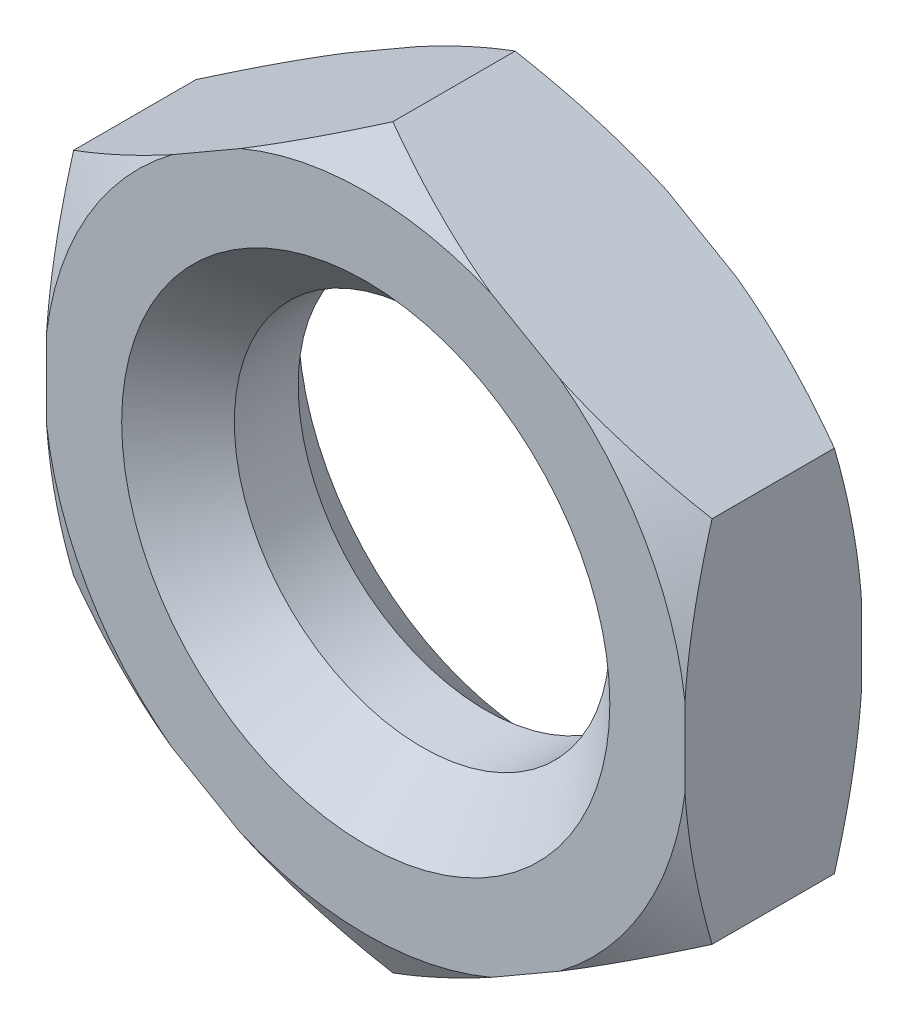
from build123d import *

# Parameters (mm, degrees)
BOSS_EXTRUDE1_DEPTH = 2.35
SKETCH6_R           = 5
CUT_EXTRUDE1_DEPTH  = 4.7
CHAMFER1_SIZE       = 1.5


with BuildPart() as part:
    # Sketch3 → Boss-Extrude1 (new, symmetric)
    with BuildSketch(Plane.XY):
        Polygon((0, 9.814954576), (-8.5, 4.907477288), (-8.5, -4.907477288), (0, -9.814954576), (8.5, -4.907477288), (8.5, 4.907477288), align=None)
    extrude(amount=BOSS_EXTRUDE1_DEPTH, both=True)

    # Sketch5 → Cut-Revolve1 (revolve, cut)
    with BuildSketch(Plane(origin=(0, 0, 0), x_dir=(0, 0, -1), z_dir=(1, 0, 0))):
        Polygon((-2.35, 9.814954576), (-2.35, 8.564954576), (-1.628312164, 9.814954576), align=None)
    cut_revolve1 = revolve(axis=Axis((0, 0, 5.457798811), (0, 0, -1)), mode=Mode.SUBTRACT)

    # Mirror1: Cut-Revolve1 across plane
    add(cut_revolve1.mirror(Plane.XY), mode=Mode.SUBTRACT)

    # Sketch6 → Cut-Extrude1 (cut)
    with BuildSketch(Plane.XY.offset(2.35)):
        Circle(SKETCH6_R)
    extrude(amount=-CUT_EXTRUDE1_DEPTH, mode=Mode.SUBTRACT)

    # Chamfer1
    chamfer1_edges = [part.edges().sort_by_distance(p)[0] for p in [
        (-5, 0, -2.35),
        (-5, 0, 2.35),
    ]]
    chamfer(chamfer1_edges, length=CHAMFER1_SIZE)


solid = part.part
